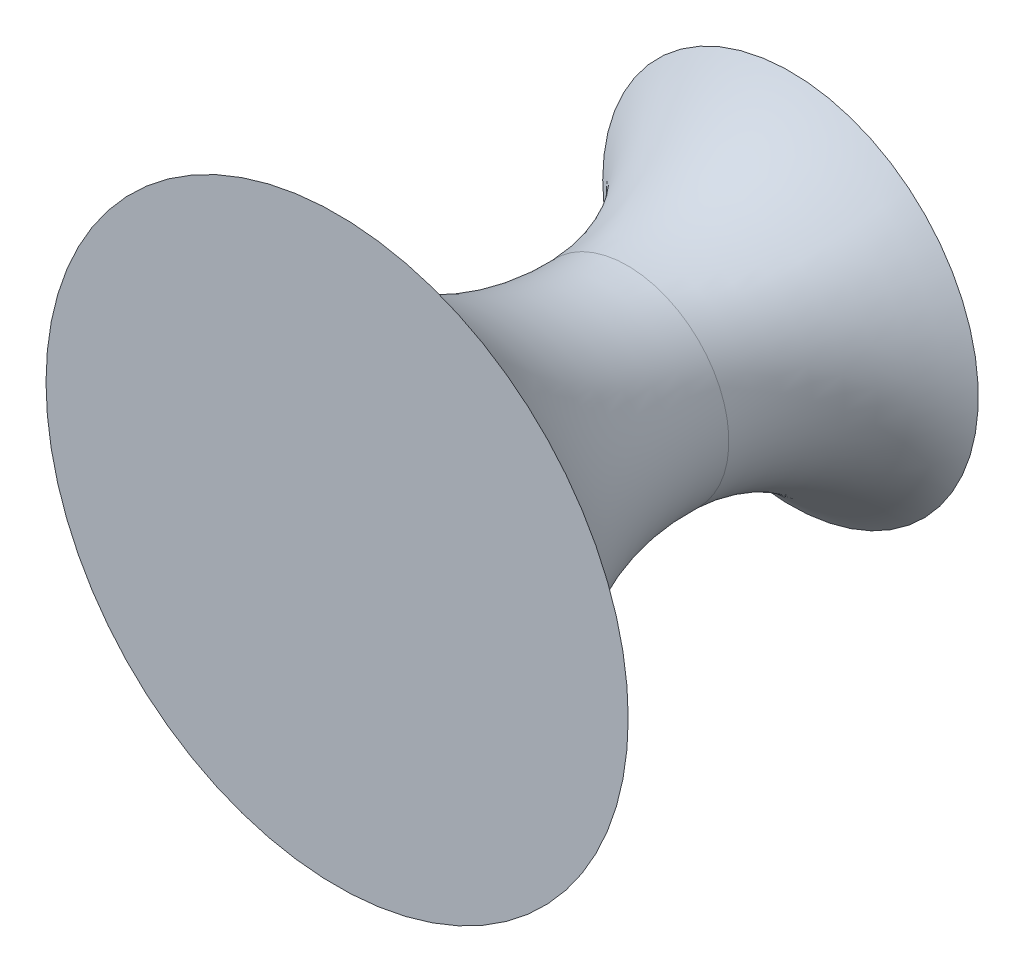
from build123d import *


with BuildPart() as part:
    # Sketch 1 → Revolve 1 (revolve)
    with BuildSketch(Plane(origin=(0, 0, 0), x_dir=(1, 0, 0), z_dir=(0, 1, 0))):
        with BuildLine():
            Line((0, 56.776470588), (-40, 56.776470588))
            ThreePointArc((-40, 56.776470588), (-26.816355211, 41.511515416), (-21.625065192, 22.02105995))
            ThreePointArc((-21.625065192, 22.02105995), (-32.033800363, -15.268458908), (-62, -39.781248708))
            Line((-62, -39.781248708), (0, -39.781248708))
            Line((0, -39.781248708), (0, 56.776470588))
        make_face()
    revolve(axis=Axis((0, 0, -82.176470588), (0, 0, 1)))


solid = part.part
